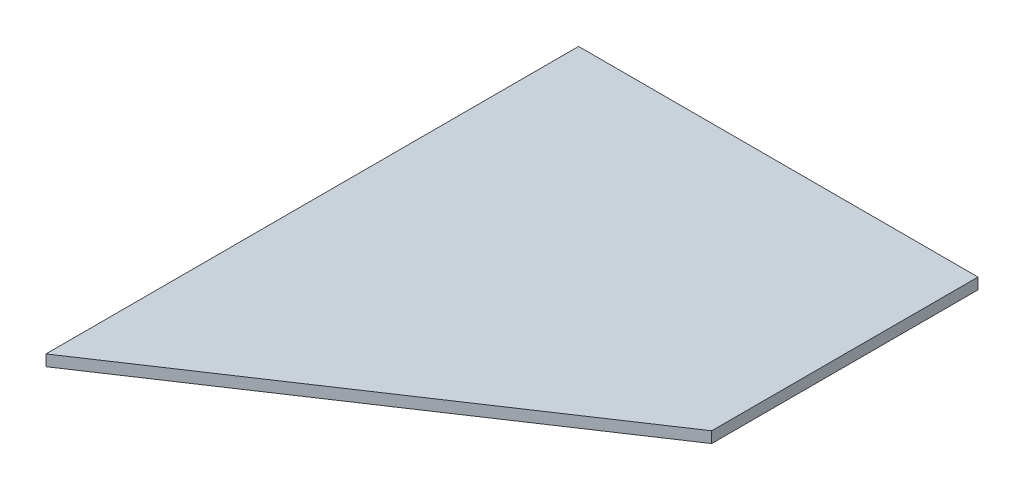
ISO-10303-21;
HEADER;
FILE_DESCRIPTION(('STEP AP214'),'2;1');
FILE_NAME('part.step','',(''),(''),'','','');
FILE_SCHEMA(('AUTOMOTIVE_DESIGN { 1 0 10303 214 1 1 1 1 }'));
ENDSEC;
DATA;
#1=APPLICATION_CONTEXT('core data for automotive mechanical design processes');
#2=APPLICATION_PROTOCOL_DEFINITION('international standard','automotive_design',2000,#1);
#3=PRODUCT_CONTEXT('',#1,'mechanical');
#4=PRODUCT('Part','Part','',(#3));
#5=PRODUCT_RELATED_PRODUCT_CATEGORY('part','',(#4));
#6=PRODUCT_DEFINITION_FORMATION('','',#4);
#7=PRODUCT_DEFINITION_CONTEXT('part definition',#1,'design');
#8=PRODUCT_DEFINITION('design','',#6,#7);
#9=PRODUCT_DEFINITION_SHAPE('','',#8);
#10=(LENGTH_UNIT() NAMED_UNIT(*) SI_UNIT(.MILLI.,.METRE.));
#11=(NAMED_UNIT(*) PLANE_ANGLE_UNIT() SI_UNIT($,.RADIAN.));
#12=(NAMED_UNIT(*) SI_UNIT($,.STERADIAN.) SOLID_ANGLE_UNIT());
#13=UNCERTAINTY_MEASURE_WITH_UNIT(LENGTH_MEASURE(1.E-05),#10,'distance_accuracy_value','');
#14=(GEOMETRIC_REPRESENTATION_CONTEXT(3) GLOBAL_UNCERTAINTY_ASSIGNED_CONTEXT((#13)) GLOBAL_UNIT_ASSIGNED_CONTEXT((#10,
#11,#12)) REPRESENTATION_CONTEXT('',''));
#15=CARTESIAN_POINT('',(0.,0.,0.));
#16=DIRECTION('',(0.,0.,1.));
#17=DIRECTION('',(1.,0.,0.));
#18=AXIS2_PLACEMENT_3D('',#15,#16,#17);
#19=CARTESIAN_POINT('',(304.8,0.,0.));
#20=DIRECTION('',(-1.,0.,0.));
#21=DIRECTION('',(0.,0.,1.));
#22=AXIS2_PLACEMENT_3D('',#19,#20,#21);
#23=PLANE('',#22);
#24=DIRECTION('',(0.,0.,-1.));
#25=VECTOR('',#24,1.);
#26=CARTESIAN_POINT('',(304.8,-82.55,-76.2));
#27=LINE('',#26,#25);
#28=CARTESIAN_POINT('',(304.8,-82.55,76.2));
#29=VERTEX_POINT('',#28);
#30=CARTESIAN_POINT('',(304.8,-82.55,-76.2));
#31=VERTEX_POINT('',#30);
#32=EDGE_CURVE('E133',#29,#31,#27,.T.);
#33=ORIENTED_EDGE('',*,*,#32,.T.);
#34=DIRECTION('',(0.,1.,0.));
#35=VECTOR('',#34,1.);
#36=CARTESIAN_POINT('',(304.8,-82.55,-76.2));
#37=LINE('',#36,#35);
#38=CARTESIAN_POINT('',(304.8,-76.2,-76.2));
#39=VERTEX_POINT('',#38);
#40=EDGE_CURVE('E12',#31,#39,#37,.T.);
#41=ORIENTED_EDGE('',*,*,#40,.T.);
#42=DIRECTION('',(0.,0.,1.));
#43=VECTOR('',#42,1.);
#44=CARTESIAN_POINT('',(304.8,-76.2,-76.2));
#45=LINE('',#44,#43);
#46=CARTESIAN_POINT('',(304.8,-76.2,76.2));
#47=VERTEX_POINT('',#46);
#48=EDGE_CURVE('E64',#39,#47,#45,.T.);
#49=ORIENTED_EDGE('',*,*,#48,.T.);
#50=DIRECTION('',(0.,-1.,0.));
#51=VECTOR('',#50,1.);
#52=CARTESIAN_POINT('',(304.8,-82.55,76.2));
#53=LINE('',#52,#51);
#54=EDGE_CURVE('E72',#47,#29,#53,.T.);
#55=ORIENTED_EDGE('',*,*,#54,.T.);
#56=EDGE_LOOP('',(#33,#41,#49,#55));
#57=FACE_BOUND('',#56,.T.);
#58=ADVANCED_FACE('F52',(#57),#23,.F.);
#59=CARTESIAN_POINT('',(0.,0.,0.));
#60=DIRECTION('',(-1.,0.,0.));
#61=DIRECTION('',(0.,0.,1.));
#62=AXIS2_PLACEMENT_3D('',#59,#60,#61);
#63=PLANE('',#62);
#64=DIRECTION('',(0.,0.,-1.));
#65=VECTOR('',#64,1.);
#66=CARTESIAN_POINT('',(0.,-158.75,-152.4));
#67=LINE('',#66,#65);
#68=CARTESIAN_POINT('',(0.,-158.75,152.4));
#69=VERTEX_POINT('',#68);
#70=CARTESIAN_POINT('',(0.,-158.75,-152.4));
#71=VERTEX_POINT('',#70);
#72=EDGE_CURVE('E105',#69,#71,#67,.T.);
#73=ORIENTED_EDGE('',*,*,#72,.F.);
#74=DIRECTION('',(0.,-1.,0.));
#75=VECTOR('',#74,1.);
#76=CARTESIAN_POINT('',(0.,-158.75,152.4));
#77=LINE('',#76,#75);
#78=CARTESIAN_POINT('',(0.,-152.4,152.4));
#79=VERTEX_POINT('',#78);
#80=EDGE_CURVE('E125',#79,#69,#77,.T.);
#81=ORIENTED_EDGE('',*,*,#80,.F.);
#82=DIRECTION('',(0.,0.,1.));
#83=VECTOR('',#82,1.);
#84=CARTESIAN_POINT('',(0.,-152.4,-152.4));
#85=LINE('',#84,#83);
#86=CARTESIAN_POINT('',(0.,-152.4,-152.4));
#87=VERTEX_POINT('',#86);
#88=EDGE_CURVE('E102',#87,#79,#85,.T.);
#89=ORIENTED_EDGE('',*,*,#88,.F.);
#90=DIRECTION('',(0.,1.,0.));
#91=VECTOR('',#90,1.);
#92=CARTESIAN_POINT('',(0.,-158.75,-152.4));
#93=LINE('',#92,#91);
#94=EDGE_CURVE('E100',#71,#87,#93,.T.);
#95=ORIENTED_EDGE('',*,*,#94,.F.);
#96=EDGE_LOOP('',(#73,#81,#89,#95));
#97=FACE_BOUND('',#96,.T.);
#98=ADVANCED_FACE('F99',(#97),#63,.T.);
#99=CARTESIAN_POINT('',(35.8588235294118,0.,143.435294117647));
#100=DIRECTION('',(-0.242535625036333,0.,-0.970142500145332));
#101=DIRECTION('',(-0.970142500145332,0.,0.242535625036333));
#102=AXIS2_PLACEMENT_3D('',#99,#100,#101);
#103=PLANE('',#102);
#104=DIRECTION('',(0.942809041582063,0.235702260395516,-0.235702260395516));
#105=VECTOR('',#104,1.);
#106=CARTESIAN_POINT('',(0.,-158.75,152.4));
#107=LINE('',#106,#105);
#108=EDGE_CURVE('E112',#69,#29,#107,.T.);
#109=ORIENTED_EDGE('',*,*,#108,.T.);
#110=ORIENTED_EDGE('',*,*,#54,.F.);
#111=DIRECTION('',(0.942809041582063,0.235702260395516,-0.235702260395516));
#112=VECTOR('',#111,1.);
#113=CARTESIAN_POINT('',(0.,-152.4,152.4));
#114=LINE('',#113,#112);
#115=EDGE_CURVE('E128',#79,#47,#114,.T.);
#116=ORIENTED_EDGE('',*,*,#115,.F.);
#117=ORIENTED_EDGE('',*,*,#80,.T.);
#118=EDGE_LOOP('',(#109,#110,#116,#117));
#119=FACE_BOUND('',#118,.T.);
#120=ADVANCED_FACE('F163',(#119),#103,.F.);
#121=CARTESIAN_POINT('',(35.8588235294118,-143.435294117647,0.));
#122=DIRECTION('',(0.242535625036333,-0.970142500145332,0.));
#123=DIRECTION('',(0.970142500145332,0.242535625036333,0.));
#124=AXIS2_PLACEMENT_3D('',#121,#122,#123);
#125=PLANE('',#124);
#126=ORIENTED_EDGE('',*,*,#115,.T.);
#127=ORIENTED_EDGE('',*,*,#48,.F.);
#128=DIRECTION('',(0.942809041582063,0.235702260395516,0.235702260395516));
#129=VECTOR('',#128,1.);
#130=CARTESIAN_POINT('',(0.,-152.4,-152.4));
#131=LINE('',#130,#129);
#132=EDGE_CURVE('E129',#87,#39,#131,.T.);
#133=ORIENTED_EDGE('',*,*,#132,.F.);
#134=ORIENTED_EDGE('',*,*,#88,.T.);
#135=EDGE_LOOP('',(#126,#127,#133,#134));
#136=FACE_BOUND('',#135,.T.);
#137=ADVANCED_FACE('F152',(#136),#125,.F.);
#138=CARTESIAN_POINT('',(37.3529411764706,-149.411764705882,0.));
#139=DIRECTION('',(-0.242535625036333,0.970142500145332,0.));
#140=DIRECTION('',(-0.970142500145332,-0.242535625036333,0.));
#141=AXIS2_PLACEMENT_3D('',#138,#139,#140);
#142=PLANE('',#141);
#143=DIRECTION('',(0.942809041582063,0.235702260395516,0.235702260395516));
#144=VECTOR('',#143,1.);
#145=CARTESIAN_POINT('',(0.,-158.75,-152.4));
#146=LINE('',#145,#144);
#147=EDGE_CURVE('E116',#71,#31,#146,.T.);
#148=ORIENTED_EDGE('',*,*,#147,.T.);
#149=ORIENTED_EDGE('',*,*,#32,.F.);
#150=ORIENTED_EDGE('',*,*,#108,.F.);
#151=ORIENTED_EDGE('',*,*,#72,.T.);
#152=EDGE_LOOP('',(#148,#149,#150,#151));
#153=FACE_BOUND('',#152,.T.);
#154=ADVANCED_FACE('F119',(#153),#142,.F.);
#155=CARTESIAN_POINT('',(35.8588235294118,0.,-143.435294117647));
#156=DIRECTION('',(-0.242535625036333,0.,0.970142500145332));
#157=DIRECTION('',(0.970142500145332,0.,0.242535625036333));
#158=AXIS2_PLACEMENT_3D('',#155,#156,#157);
#159=PLANE('',#158);
#160=ORIENTED_EDGE('',*,*,#132,.T.);
#161=ORIENTED_EDGE('',*,*,#40,.F.);
#162=ORIENTED_EDGE('',*,*,#147,.F.);
#163=ORIENTED_EDGE('',*,*,#94,.T.);
#164=EDGE_LOOP('',(#160,#161,#162,#163));
#165=FACE_BOUND('',#164,.T.);
#166=ADVANCED_FACE('F127',(#165),#159,.F.);
#167=CLOSED_SHELL('',(#58,#98,#120,#137,#154,#166));
#168=MANIFOLD_SOLID_BREP('B2',#167);
#169=ADVANCED_BREP_SHAPE_REPRESENTATION('',(#18,#168),#14);
#170=SHAPE_DEFINITION_REPRESENTATION(#9,#169);
ENDSEC;
END-ISO-10303-21;
